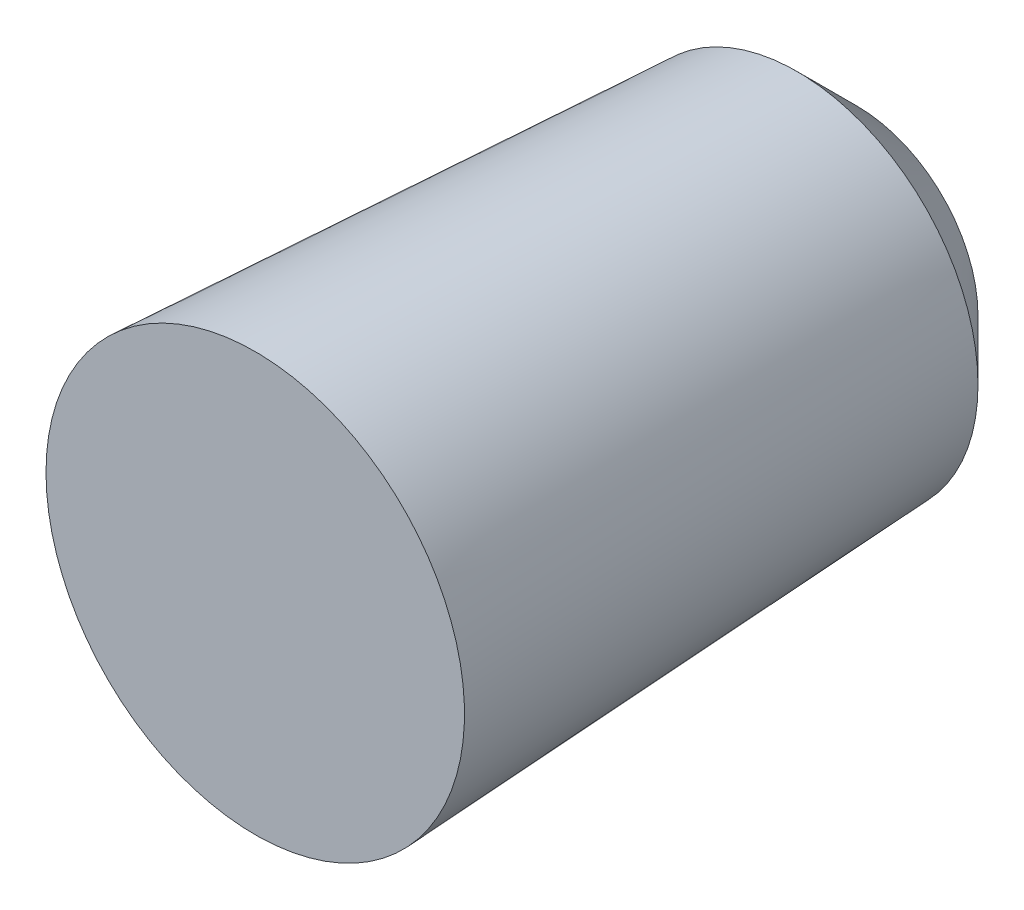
from build123d import *

# Parameters (mm, degrees)
ESQUISSE1_R        = 25
BOSS_EXTRU_1_DEPTH = 84.681363
BOSS_EXTRU_1_DRAFT = -3
CHANFREIN1_SIZE    = 8
CHANFREIN1_SIZE2   = 8.454036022


with BuildPart() as part:
    # Esquisse1 → Boss.-Extru.1 (with draft: the straight prism first)
    with BuildSketch(Plane.XY):
        with Locations((20.636300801, 75.392773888)):
            Circle(ESQUISSE1_R)
    extrude(amount=BOSS_EXTRU_1_DEPTH)
    # Boss.-Extru.1: the draft: its side faces are tilted about the plane it starts from
    boss_extru_1_sides = [part.faces().sort_by_distance(p)[0] for p in [
        (-4.363699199, 75.392773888, 42.3406815),
    ]]
    draft(boss_extru_1_sides, Plane.XY, BOSS_EXTRU_1_DRAFT)

    # Chanfrein1
    chanfrein1_edges = [part.edges().sort_by_distance(p)[0] for p in [
        (-4.363699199, 75.392773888, 0),
    ]]
    chanfrein1_side = [part.faces().sort_by_distance(p)[0] for p in [
        (20.636300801, 75.392773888, 0),
    ]]
    chamfer(chanfrein1_edges, length=CHANFREIN1_SIZE, length2=CHANFREIN1_SIZE2, reference=chanfrein1_side[0])


solid = part.part
